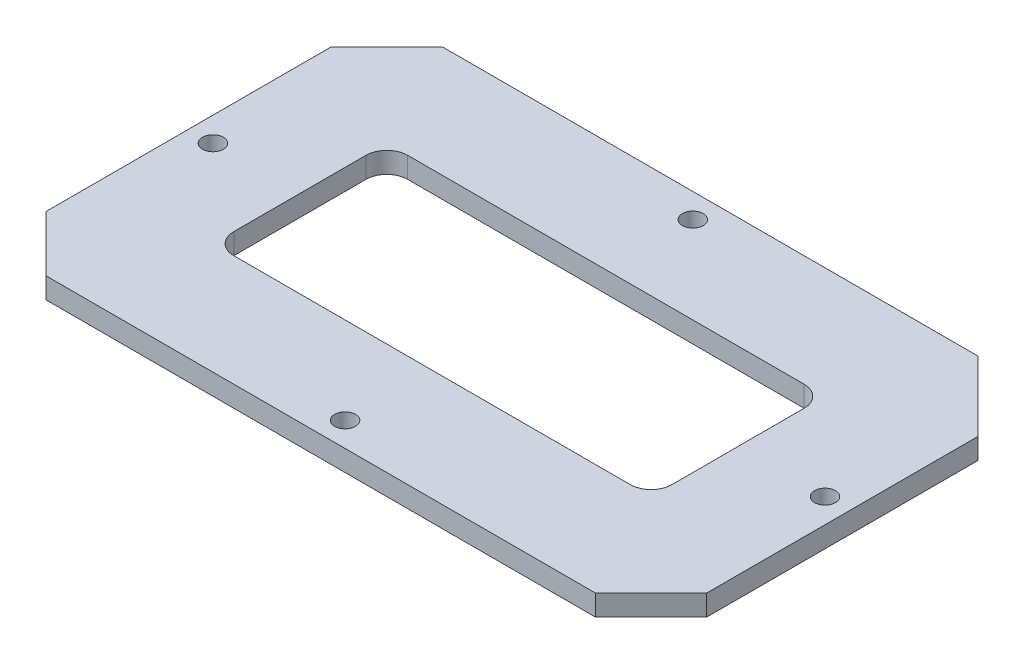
ISO-10303-21;
HEADER;
FILE_DESCRIPTION(('STEP AP214'),'2;1');
FILE_NAME('part.step','',(''),(''),'','','');
FILE_SCHEMA(('AUTOMOTIVE_DESIGN { 1 0 10303 214 1 1 1 1 }'));
ENDSEC;
DATA;
#1=APPLICATION_CONTEXT('core data for automotive mechanical design processes');
#2=APPLICATION_PROTOCOL_DEFINITION('international standard','automotive_design',2000,#1);
#3=PRODUCT_CONTEXT('',#1,'mechanical');
#4=PRODUCT('Part','Part','',(#3));
#5=PRODUCT_RELATED_PRODUCT_CATEGORY('part','',(#4));
#6=PRODUCT_DEFINITION_FORMATION('','',#4);
#7=PRODUCT_DEFINITION_CONTEXT('part definition',#1,'design');
#8=PRODUCT_DEFINITION('design','',#6,#7);
#9=PRODUCT_DEFINITION_SHAPE('','',#8);
#10=(LENGTH_UNIT() NAMED_UNIT(*) SI_UNIT(.MILLI.,.METRE.));
#11=(NAMED_UNIT(*) PLANE_ANGLE_UNIT() SI_UNIT($,.RADIAN.));
#12=(NAMED_UNIT(*) SI_UNIT($,.STERADIAN.) SOLID_ANGLE_UNIT());
#13=UNCERTAINTY_MEASURE_WITH_UNIT(LENGTH_MEASURE(1.E-05),#10,'distance_accuracy_value','');
#14=(GEOMETRIC_REPRESENTATION_CONTEXT(3) GLOBAL_UNCERTAINTY_ASSIGNED_CONTEXT((#13)) GLOBAL_UNIT_ASSIGNED_CONTEXT((#10,
#11,#12)) REPRESENTATION_CONTEXT('',''));
#15=CARTESIAN_POINT('',(0.,0.,0.));
#16=DIRECTION('',(0.,0.,1.));
#17=DIRECTION('',(1.,0.,0.));
#18=AXIS2_PLACEMENT_3D('',#15,#16,#17);
#19=CARTESIAN_POINT('',(0.,3.,0.));
#20=DIRECTION('',(0.,-1.,0.));
#21=DIRECTION('',(0.,0.,-1.));
#22=AXIS2_PLACEMENT_3D('',#19,#20,#21);
#23=PLANE('',#22);
#24=CARTESIAN_POINT('',(-44.,3.,0.));
#25=DIRECTION('',(0.,1.,0.));
#26=DIRECTION('',(0.,0.,1.));
#27=AXIS2_PLACEMENT_3D('',#24,#25,#26);
#28=CIRCLE('',#27,1.5);
#29=CARTESIAN_POINT('',(-44.,3.,1.5));
#30=VERTEX_POINT('',#29);
#31=EDGE_CURVE('E403',#30,#30,#28,.T.);
#32=ORIENTED_EDGE('',*,*,#31,.F.);
#33=EDGE_LOOP('',(#32));
#34=FACE_BOUND('',#33,.T.);
#35=CARTESIAN_POINT('',(0.,3.,-25.));
#36=DIRECTION('',(0.,1.,0.));
#37=DIRECTION('',(0.,0.,1.));
#38=AXIS2_PLACEMENT_3D('',#35,#36,#37);
#39=CIRCLE('',#38,1.5);
#40=CARTESIAN_POINT('',(0.,3.,-23.5));
#41=VERTEX_POINT('',#40);
#42=EDGE_CURVE('E198',#41,#41,#39,.T.);
#43=ORIENTED_EDGE('',*,*,#42,.F.);
#44=EDGE_LOOP('',(#43));
#45=FACE_BOUND('',#44,.T.);
#46=DIRECTION('',(-1.,0.,0.));
#47=VECTOR('',#46,1.);
#48=CARTESIAN_POINT('',(-39.5,3.,-28.5));
#49=LINE('',#48,#47);
#50=CARTESIAN_POINT('',(37.5,3.,-28.5));
#51=VERTEX_POINT('',#50);
#52=CARTESIAN_POINT('',(-39.5,3.,-28.5));
#53=VERTEX_POINT('',#52);
#54=EDGE_CURVE('E228',#51,#53,#49,.T.);
#55=ORIENTED_EDGE('',*,*,#54,.T.);
#56=DIRECTION('',(-0.707106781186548,0.,0.707106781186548));
#57=VECTOR('',#56,1.);
#58=CARTESIAN_POINT('',(-47.5,3.,-20.5));
#59=LINE('',#58,#57);
#60=CARTESIAN_POINT('',(-47.5,3.,-20.5));
#61=VERTEX_POINT('',#60);
#62=EDGE_CURVE('E231',#53,#61,#59,.T.);
#63=ORIENTED_EDGE('',*,*,#62,.T.);
#64=DIRECTION('',(0.,0.,1.));
#65=VECTOR('',#64,1.);
#66=CARTESIAN_POINT('',(-47.5,3.,-20.5));
#67=LINE('',#66,#65);
#68=CARTESIAN_POINT('',(-47.5,3.,20.5));
#69=VERTEX_POINT('',#68);
#70=EDGE_CURVE('E234',#61,#69,#67,.T.);
#71=ORIENTED_EDGE('',*,*,#70,.T.);
#72=DIRECTION('',(0.707106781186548,0.,0.707106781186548));
#73=VECTOR('',#72,1.);
#74=CARTESIAN_POINT('',(-47.5,3.,20.5));
#75=LINE('',#74,#73);
#76=CARTESIAN_POINT('',(-39.5,3.,28.5));
#77=VERTEX_POINT('',#76);
#78=EDGE_CURVE('E236',#69,#77,#75,.T.);
#79=ORIENTED_EDGE('',*,*,#78,.T.);
#80=DIRECTION('',(1.,0.,0.));
#81=VECTOR('',#80,1.);
#82=CARTESIAN_POINT('',(-39.5,3.,28.5));
#83=LINE('',#82,#81);
#84=CARTESIAN_POINT('',(39.5,3.,28.5));
#85=VERTEX_POINT('',#84);
#86=EDGE_CURVE('E238',#77,#85,#83,.T.);
#87=ORIENTED_EDGE('',*,*,#86,.T.);
#88=DIRECTION('',(0.707106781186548,0.,-0.707106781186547));
#89=VECTOR('',#88,1.);
#90=CARTESIAN_POINT('',(39.5,3.,28.5));
#91=LINE('',#90,#89);
#92=CARTESIAN_POINT('',(47.5,3.,20.5));
#93=VERTEX_POINT('',#92);
#94=EDGE_CURVE('E240',#85,#93,#91,.T.);
#95=ORIENTED_EDGE('',*,*,#94,.T.);
#96=DIRECTION('',(0.,0.,-1.));
#97=VECTOR('',#96,1.);
#98=CARTESIAN_POINT('',(47.5,3.,-18.5));
#99=LINE('',#98,#97);
#100=CARTESIAN_POINT('',(47.5,3.,-18.5));
#101=VERTEX_POINT('',#100);
#102=EDGE_CURVE('E242',#93,#101,#99,.T.);
#103=ORIENTED_EDGE('',*,*,#102,.T.);
#104=DIRECTION('',(-0.707106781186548,0.,-0.707106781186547));
#105=VECTOR('',#104,1.);
#106=CARTESIAN_POINT('',(37.5,3.,-28.5));
#107=LINE('',#106,#105);
#108=EDGE_CURVE('E244',#101,#51,#107,.T.);
#109=ORIENTED_EDGE('',*,*,#108,.T.);
#110=EDGE_LOOP('',(#55,#63,#71,#79,#87,#95,#103,#109));
#111=FACE_BOUND('',#110,.T.);
#112=CARTESIAN_POINT('',(-28.5,3.,-9.5));
#113=DIRECTION('',(0.,1.,0.));
#114=DIRECTION('',(0.,0.,1.));
#115=AXIS2_PLACEMENT_3D('',#112,#113,#114);
#116=CIRCLE('',#115,3.);
#117=CARTESIAN_POINT('',(-28.5,3.,-12.5));
#118=VERTEX_POINT('',#117);
#119=CARTESIAN_POINT('',(-31.5,3.,-9.49999999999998));
#120=VERTEX_POINT('',#119);
#121=EDGE_CURVE('E160',#118,#120,#116,.T.);
#122=ORIENTED_EDGE('',*,*,#121,.F.);
#123=DIRECTION('',(-1.,0.,0.));
#124=VECTOR('',#123,1.);
#125=CARTESIAN_POINT('',(-28.5,3.,-12.5));
#126=LINE('',#125,#124);
#127=CARTESIAN_POINT('',(28.5,3.,-12.5));
#128=VERTEX_POINT('',#127);
#129=EDGE_CURVE('E195',#128,#118,#126,.T.);
#130=ORIENTED_EDGE('',*,*,#129,.F.);
#131=CARTESIAN_POINT('',(28.5,3.,-9.50000000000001));
#132=DIRECTION('',(0.,1.,0.));
#133=DIRECTION('',(0.,0.,-1.));
#134=AXIS2_PLACEMENT_3D('',#131,#132,#133);
#135=CIRCLE('',#134,3.);
#136=CARTESIAN_POINT('',(31.5,3.,-9.49999999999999));
#137=VERTEX_POINT('',#136);
#138=EDGE_CURVE('E193',#137,#128,#135,.T.);
#139=ORIENTED_EDGE('',*,*,#138,.F.);
#140=DIRECTION('',(0.,0.,-1.));
#141=VECTOR('',#140,1.);
#142=CARTESIAN_POINT('',(31.5,3.,-9.49999999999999));
#143=LINE('',#142,#141);
#144=CARTESIAN_POINT('',(31.5,3.,9.49999999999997));
#145=VERTEX_POINT('',#144);
#146=EDGE_CURVE('E191',#145,#137,#143,.T.);
#147=ORIENTED_EDGE('',*,*,#146,.F.);
#148=CARTESIAN_POINT('',(28.5,3.,9.49999999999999));
#149=DIRECTION('',(0.,1.,0.));
#150=DIRECTION('',(0.,0.,1.));
#151=AXIS2_PLACEMENT_3D('',#148,#149,#150);
#152=CIRCLE('',#151,3.);
#153=CARTESIAN_POINT('',(28.5,3.,12.5));
#154=VERTEX_POINT('',#153);
#155=EDGE_CURVE('E189',#154,#145,#152,.T.);
#156=ORIENTED_EDGE('',*,*,#155,.F.);
#157=DIRECTION('',(1.,0.,0.));
#158=VECTOR('',#157,1.);
#159=CARTESIAN_POINT('',(-28.5,3.,12.5));
#160=LINE('',#159,#158);
#161=CARTESIAN_POINT('',(-28.5,3.,12.5));
#162=VERTEX_POINT('',#161);
#163=EDGE_CURVE('E184',#162,#154,#160,.T.);
#164=ORIENTED_EDGE('',*,*,#163,.F.);
#165=CARTESIAN_POINT('',(-28.5,3.,9.5));
#166=DIRECTION('',(0.,1.,0.));
#167=DIRECTION('',(0.,0.,1.));
#168=AXIS2_PLACEMENT_3D('',#165,#166,#167);
#169=CIRCLE('',#168,3.);
#170=CARTESIAN_POINT('',(-31.5,3.,9.49999999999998));
#171=VERTEX_POINT('',#170);
#172=EDGE_CURVE('E182',#171,#162,#169,.T.);
#173=ORIENTED_EDGE('',*,*,#172,.F.);
#174=DIRECTION('',(0.,0.,1.));
#175=VECTOR('',#174,1.);
#176=CARTESIAN_POINT('',(-31.5,3.,-9.49999999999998));
#177=LINE('',#176,#175);
#178=EDGE_CURVE('E168',#120,#171,#177,.T.);
#179=ORIENTED_EDGE('',*,*,#178,.F.);
#180=EDGE_LOOP('',(#122,#130,#139,#147,#156,#164,#173,#179));
#181=FACE_BOUND('',#180,.T.);
#182=CARTESIAN_POINT('',(0.,3.,25.));
#183=DIRECTION('',(0.,1.,0.));
#184=DIRECTION('',(0.,0.,-1.));
#185=AXIS2_PLACEMENT_3D('',#182,#183,#184);
#186=CIRCLE('',#185,1.5);
#187=CARTESIAN_POINT('',(0.,3.,23.5));
#188=VERTEX_POINT('',#187);
#189=EDGE_CURVE('E409',#188,#188,#186,.T.);
#190=ORIENTED_EDGE('',*,*,#189,.F.);
#191=EDGE_LOOP('',(#190));
#192=FACE_BOUND('',#191,.T.);
#193=CARTESIAN_POINT('',(44.,3.,0.));
#194=DIRECTION('',(0.,1.,0.));
#195=DIRECTION('',(0.,0.,-1.));
#196=AXIS2_PLACEMENT_3D('',#193,#194,#195);
#197=CIRCLE('',#196,1.5);
#198=CARTESIAN_POINT('',(44.,3.,-1.50000000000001));
#199=VERTEX_POINT('',#198);
#200=EDGE_CURVE('E394',#199,#199,#197,.T.);
#201=ORIENTED_EDGE('',*,*,#200,.F.);
#202=EDGE_LOOP('',(#201));
#203=FACE_BOUND('',#202,.T.);
#204=ADVANCED_FACE('F47',(#34,#45,#111,#181,#192,#203),#23,.F.);
#205=CARTESIAN_POINT('',(0.,0.,0.));
#206=DIRECTION('',(0.,-1.,0.));
#207=DIRECTION('',(0.,0.,-1.));
#208=AXIS2_PLACEMENT_3D('',#205,#206,#207);
#209=PLANE('',#208);
#210=CARTESIAN_POINT('',(-44.,0.,0.));
#211=DIRECTION('',(0.,1.,0.));
#212=DIRECTION('',(0.,0.,1.));
#213=AXIS2_PLACEMENT_3D('',#210,#211,#212);
#214=CIRCLE('',#213,1.5);
#215=CARTESIAN_POINT('',(-44.,0.,1.5));
#216=VERTEX_POINT('',#215);
#217=EDGE_CURVE('E400',#216,#216,#214,.T.);
#218=ORIENTED_EDGE('',*,*,#217,.T.);
#219=EDGE_LOOP('',(#218));
#220=FACE_BOUND('',#219,.T.);
#221=CARTESIAN_POINT('',(0.,0.,-25.));
#222=DIRECTION('',(0.,1.,0.));
#223=DIRECTION('',(0.,0.,1.));
#224=AXIS2_PLACEMENT_3D('',#221,#222,#223);
#225=CIRCLE('',#224,1.5);
#226=CARTESIAN_POINT('',(0.,0.,-23.5));
#227=VERTEX_POINT('',#226);
#228=EDGE_CURVE('E412',#227,#227,#225,.T.);
#229=ORIENTED_EDGE('',*,*,#228,.T.);
#230=EDGE_LOOP('',(#229));
#231=FACE_BOUND('',#230,.T.);
#232=DIRECTION('',(-1.,0.,0.));
#233=VECTOR('',#232,1.);
#234=CARTESIAN_POINT('',(-39.5,0.,-28.5));
#235=LINE('',#234,#233);
#236=CARTESIAN_POINT('',(37.5,0.,-28.5));
#237=VERTEX_POINT('',#236);
#238=CARTESIAN_POINT('',(-39.5,0.,-28.5));
#239=VERTEX_POINT('',#238);
#240=EDGE_CURVE('E176',#237,#239,#235,.T.);
#241=ORIENTED_EDGE('',*,*,#240,.F.);
#242=DIRECTION('',(-0.707106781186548,0.,-0.707106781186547));
#243=VECTOR('',#242,1.);
#244=CARTESIAN_POINT('',(37.5,0.,-28.5));
#245=LINE('',#244,#243);
#246=CARTESIAN_POINT('',(47.5,0.,-18.5));
#247=VERTEX_POINT('',#246);
#248=EDGE_CURVE('E232',#247,#237,#245,.T.);
#249=ORIENTED_EDGE('',*,*,#248,.F.);
#250=DIRECTION('',(0.,0.,-1.));
#251=VECTOR('',#250,1.);
#252=CARTESIAN_POINT('',(47.5,0.,-18.5));
#253=LINE('',#252,#251);
#254=CARTESIAN_POINT('',(47.5,0.,20.5));
#255=VERTEX_POINT('',#254);
#256=EDGE_CURVE('E259',#255,#247,#253,.T.);
#257=ORIENTED_EDGE('',*,*,#256,.F.);
#258=DIRECTION('',(0.707106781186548,0.,-0.707106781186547));
#259=VECTOR('',#258,1.);
#260=CARTESIAN_POINT('',(39.5,0.,28.5));
#261=LINE('',#260,#259);
#262=CARTESIAN_POINT('',(39.5,0.,28.5));
#263=VERTEX_POINT('',#262);
#264=EDGE_CURVE('E257',#263,#255,#261,.T.);
#265=ORIENTED_EDGE('',*,*,#264,.F.);
#266=DIRECTION('',(1.,0.,0.));
#267=VECTOR('',#266,1.);
#268=CARTESIAN_POINT('',(-39.5,0.,28.5));
#269=LINE('',#268,#267);
#270=CARTESIAN_POINT('',(-39.5,0.,28.5));
#271=VERTEX_POINT('',#270);
#272=EDGE_CURVE('E255',#271,#263,#269,.T.);
#273=ORIENTED_EDGE('',*,*,#272,.F.);
#274=DIRECTION('',(0.707106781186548,0.,0.707106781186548));
#275=VECTOR('',#274,1.);
#276=CARTESIAN_POINT('',(-47.5,0.,20.5));
#277=LINE('',#276,#275);
#278=CARTESIAN_POINT('',(-47.5,0.,20.5));
#279=VERTEX_POINT('',#278);
#280=EDGE_CURVE('E253',#279,#271,#277,.T.);
#281=ORIENTED_EDGE('',*,*,#280,.F.);
#282=DIRECTION('',(0.,0.,1.));
#283=VECTOR('',#282,1.);
#284=CARTESIAN_POINT('',(-47.5,0.,-20.5));
#285=LINE('',#284,#283);
#286=CARTESIAN_POINT('',(-47.5,0.,-20.5));
#287=VERTEX_POINT('',#286);
#288=EDGE_CURVE('E251',#287,#279,#285,.T.);
#289=ORIENTED_EDGE('',*,*,#288,.F.);
#290=DIRECTION('',(-0.707106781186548,0.,0.707106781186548));
#291=VECTOR('',#290,1.);
#292=CARTESIAN_POINT('',(-47.5,0.,-20.5));
#293=LINE('',#292,#291);
#294=EDGE_CURVE('E249',#239,#287,#293,.T.);
#295=ORIENTED_EDGE('',*,*,#294,.F.);
#296=EDGE_LOOP('',(#241,#249,#257,#265,#273,#281,#289,#295));
#297=FACE_BOUND('',#296,.T.);
#298=DIRECTION('',(-1.,0.,0.));
#299=VECTOR('',#298,1.);
#300=CARTESIAN_POINT('',(-28.5,0.,-12.5));
#301=LINE('',#300,#299);
#302=CARTESIAN_POINT('',(28.5,0.,-12.5));
#303=VERTEX_POINT('',#302);
#304=CARTESIAN_POINT('',(-28.5,0.,-12.5));
#305=VERTEX_POINT('',#304);
#306=EDGE_CURVE('E169',#303,#305,#301,.T.);
#307=ORIENTED_EDGE('',*,*,#306,.T.);
#308=CARTESIAN_POINT('',(-28.5,0.,-9.5));
#309=DIRECTION('',(0.,1.,0.));
#310=DIRECTION('',(0.,0.,1.));
#311=AXIS2_PLACEMENT_3D('',#308,#309,#310);
#312=CIRCLE('',#311,3.);
#313=CARTESIAN_POINT('',(-31.5,0.,-9.49999999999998));
#314=VERTEX_POINT('',#313);
#315=EDGE_CURVE('E70',#305,#314,#312,.T.);
#316=ORIENTED_EDGE('',*,*,#315,.T.);
#317=DIRECTION('',(0.,0.,1.));
#318=VECTOR('',#317,1.);
#319=CARTESIAN_POINT('',(-31.5,0.,-9.49999999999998));
#320=LINE('',#319,#318);
#321=CARTESIAN_POINT('',(-31.5,0.,9.49999999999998));
#322=VERTEX_POINT('',#321);
#323=EDGE_CURVE('E175',#314,#322,#320,.T.);
#324=ORIENTED_EDGE('',*,*,#323,.T.);
#325=CARTESIAN_POINT('',(-28.5,0.,9.5));
#326=DIRECTION('',(0.,1.,0.));
#327=DIRECTION('',(0.,0.,1.));
#328=AXIS2_PLACEMENT_3D('',#325,#326,#327);
#329=CIRCLE('',#328,3.);
#330=CARTESIAN_POINT('',(-28.5,0.,12.5));
#331=VERTEX_POINT('',#330);
#332=EDGE_CURVE('E200',#322,#331,#329,.T.);
#333=ORIENTED_EDGE('',*,*,#332,.T.);
#334=DIRECTION('',(1.,0.,0.));
#335=VECTOR('',#334,1.);
#336=CARTESIAN_POINT('',(-28.5,0.,12.5));
#337=LINE('',#336,#335);
#338=CARTESIAN_POINT('',(28.5,0.,12.5));
#339=VERTEX_POINT('',#338);
#340=EDGE_CURVE('E203',#331,#339,#337,.T.);
#341=ORIENTED_EDGE('',*,*,#340,.T.);
#342=CARTESIAN_POINT('',(28.5,0.,9.49999999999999));
#343=DIRECTION('',(0.,1.,0.));
#344=DIRECTION('',(0.,0.,1.));
#345=AXIS2_PLACEMENT_3D('',#342,#343,#344);
#346=CIRCLE('',#345,3.);
#347=CARTESIAN_POINT('',(31.5,0.,9.49999999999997));
#348=VERTEX_POINT('',#347);
#349=EDGE_CURVE('E206',#339,#348,#346,.T.);
#350=ORIENTED_EDGE('',*,*,#349,.T.);
#351=DIRECTION('',(0.,0.,-1.));
#352=VECTOR('',#351,1.);
#353=CARTESIAN_POINT('',(31.5,0.,-9.49999999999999));
#354=LINE('',#353,#352);
#355=CARTESIAN_POINT('',(31.5,0.,-9.49999999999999));
#356=VERTEX_POINT('',#355);
#357=EDGE_CURVE('E209',#348,#356,#354,.T.);
#358=ORIENTED_EDGE('',*,*,#357,.T.);
#359=CARTESIAN_POINT('',(28.5,0.,-9.50000000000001));
#360=DIRECTION('',(0.,1.,0.));
#361=DIRECTION('',(0.,0.,-1.));
#362=AXIS2_PLACEMENT_3D('',#359,#360,#361);
#363=CIRCLE('',#362,3.);
#364=EDGE_CURVE('E212',#356,#303,#363,.T.);
#365=ORIENTED_EDGE('',*,*,#364,.T.);
#366=EDGE_LOOP('',(#307,#316,#324,#333,#341,#350,#358,#365));
#367=FACE_BOUND('',#366,.T.);
#368=CARTESIAN_POINT('',(0.,0.,25.));
#369=DIRECTION('',(0.,1.,0.));
#370=DIRECTION('',(0.,0.,-1.));
#371=AXIS2_PLACEMENT_3D('',#368,#369,#370);
#372=CIRCLE('',#371,1.5);
#373=CARTESIAN_POINT('',(0.,0.,23.5));
#374=VERTEX_POINT('',#373);
#375=EDGE_CURVE('E406',#374,#374,#372,.T.);
#376=ORIENTED_EDGE('',*,*,#375,.T.);
#377=EDGE_LOOP('',(#376));
#378=FACE_BOUND('',#377,.T.);
#379=CARTESIAN_POINT('',(44.,0.,0.));
#380=DIRECTION('',(0.,1.,0.));
#381=DIRECTION('',(0.,0.,-1.));
#382=AXIS2_PLACEMENT_3D('',#379,#380,#381);
#383=CIRCLE('',#382,1.5);
#384=CARTESIAN_POINT('',(44.,0.,-1.50000000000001));
#385=VERTEX_POINT('',#384);
#386=EDGE_CURVE('E397',#385,#385,#383,.T.);
#387=ORIENTED_EDGE('',*,*,#386,.T.);
#388=EDGE_LOOP('',(#387));
#389=FACE_BOUND('',#388,.T.);
#390=ADVANCED_FACE('F289',(#220,#231,#297,#367,#378,#389),#209,.T.);
#391=CARTESIAN_POINT('',(-39.5,3.,-28.5));
#392=DIRECTION('',(0.,0.,1.));
#393=DIRECTION('',(1.,0.,0.));
#394=AXIS2_PLACEMENT_3D('',#391,#392,#393);
#395=PLANE('',#394);
#396=ORIENTED_EDGE('',*,*,#240,.T.);
#397=DIRECTION('',(0.,-1.,0.));
#398=VECTOR('',#397,1.);
#399=CARTESIAN_POINT('',(-39.5,3.,-28.5));
#400=LINE('',#399,#398);
#401=EDGE_CURVE('E13',#53,#239,#400,.T.);
#402=ORIENTED_EDGE('',*,*,#401,.F.);
#403=ORIENTED_EDGE('',*,*,#54,.F.);
#404=DIRECTION('',(0.,-1.,0.));
#405=VECTOR('',#404,1.);
#406=CARTESIAN_POINT('',(37.5,3.,-28.5));
#407=LINE('',#406,#405);
#408=EDGE_CURVE('E246',#51,#237,#407,.T.);
#409=ORIENTED_EDGE('',*,*,#408,.T.);
#410=EDGE_LOOP('',(#396,#402,#403,#409));
#411=FACE_BOUND('',#410,.T.);
#412=ADVANCED_FACE('F49',(#411),#395,.F.);
#413=CARTESIAN_POINT('',(-47.5,3.,-20.5));
#414=DIRECTION('',(0.707106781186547,0.,0.707106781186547));
#415=DIRECTION('',(0.707106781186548,0.,-0.707106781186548));
#416=AXIS2_PLACEMENT_3D('',#413,#414,#415);
#417=PLANE('',#416);
#418=ORIENTED_EDGE('',*,*,#294,.T.);
#419=DIRECTION('',(0.,-1.,0.));
#420=VECTOR('',#419,1.);
#421=CARTESIAN_POINT('',(-47.5,3.,-20.5));
#422=LINE('',#421,#420);
#423=EDGE_CURVE('E55',#61,#287,#422,.T.);
#424=ORIENTED_EDGE('',*,*,#423,.F.);
#425=ORIENTED_EDGE('',*,*,#62,.F.);
#426=ORIENTED_EDGE('',*,*,#401,.T.);
#427=EDGE_LOOP('',(#418,#424,#425,#426));
#428=FACE_BOUND('',#427,.T.);
#429=ADVANCED_FACE('F306',(#428),#417,.F.);
#430=CARTESIAN_POINT('',(-47.5,3.,-20.5));
#431=DIRECTION('',(1.,0.,0.));
#432=DIRECTION('',(0.,0.,-1.));
#433=AXIS2_PLACEMENT_3D('',#430,#431,#432);
#434=PLANE('',#433);
#435=ORIENTED_EDGE('',*,*,#288,.T.);
#436=DIRECTION('',(0.,-1.,0.));
#437=VECTOR('',#436,1.);
#438=CARTESIAN_POINT('',(-47.5,3.,20.5));
#439=LINE('',#438,#437);
#440=EDGE_CURVE('E276',#69,#279,#439,.T.);
#441=ORIENTED_EDGE('',*,*,#440,.F.);
#442=ORIENTED_EDGE('',*,*,#70,.F.);
#443=ORIENTED_EDGE('',*,*,#423,.T.);
#444=EDGE_LOOP('',(#435,#441,#442,#443));
#445=FACE_BOUND('',#444,.T.);
#446=ADVANCED_FACE('F283',(#445),#434,.F.);
#447=CARTESIAN_POINT('',(-47.5,3.,20.5));
#448=DIRECTION('',(0.707106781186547,0.,-0.707106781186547));
#449=DIRECTION('',(-0.707106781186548,0.,-0.707106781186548));
#450=AXIS2_PLACEMENT_3D('',#447,#448,#449);
#451=PLANE('',#450);
#452=ORIENTED_EDGE('',*,*,#280,.T.);
#453=DIRECTION('',(0.,-1.,0.));
#454=VECTOR('',#453,1.);
#455=CARTESIAN_POINT('',(-39.5,3.,28.5));
#456=LINE('',#455,#454);
#457=EDGE_CURVE('E273',#77,#271,#456,.T.);
#458=ORIENTED_EDGE('',*,*,#457,.F.);
#459=ORIENTED_EDGE('',*,*,#78,.F.);
#460=ORIENTED_EDGE('',*,*,#440,.T.);
#461=EDGE_LOOP('',(#452,#458,#459,#460));
#462=FACE_BOUND('',#461,.T.);
#463=ADVANCED_FACE('F295',(#462),#451,.F.);
#464=CARTESIAN_POINT('',(-39.5,3.,28.5));
#465=DIRECTION('',(0.,0.,-1.));
#466=DIRECTION('',(-1.,0.,0.));
#467=AXIS2_PLACEMENT_3D('',#464,#465,#466);
#468=PLANE('',#467);
#469=ORIENTED_EDGE('',*,*,#272,.T.);
#470=DIRECTION('',(0.,-1.,0.));
#471=VECTOR('',#470,1.);
#472=CARTESIAN_POINT('',(39.5,3.,28.5));
#473=LINE('',#472,#471);
#474=EDGE_CURVE('E270',#85,#263,#473,.T.);
#475=ORIENTED_EDGE('',*,*,#474,.F.);
#476=ORIENTED_EDGE('',*,*,#86,.F.);
#477=ORIENTED_EDGE('',*,*,#457,.T.);
#478=EDGE_LOOP('',(#469,#475,#476,#477));
#479=FACE_BOUND('',#478,.T.);
#480=ADVANCED_FACE('F299',(#479),#468,.F.);
#481=CARTESIAN_POINT('',(39.5,3.,28.5));
#482=DIRECTION('',(-0.707106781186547,0.,-0.707106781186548));
#483=DIRECTION('',(-0.707106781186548,0.,0.707106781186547));
#484=AXIS2_PLACEMENT_3D('',#481,#482,#483);
#485=PLANE('',#484);
#486=ORIENTED_EDGE('',*,*,#264,.T.);
#487=DIRECTION('',(0.,-1.,0.));
#488=VECTOR('',#487,1.);
#489=CARTESIAN_POINT('',(47.5,3.,20.5));
#490=LINE('',#489,#488);
#491=EDGE_CURVE('E267',#93,#255,#490,.T.);
#492=ORIENTED_EDGE('',*,*,#491,.F.);
#493=ORIENTED_EDGE('',*,*,#94,.F.);
#494=ORIENTED_EDGE('',*,*,#474,.T.);
#495=EDGE_LOOP('',(#486,#492,#493,#494));
#496=FACE_BOUND('',#495,.T.);
#497=ADVANCED_FACE('F319',(#496),#485,.F.);
#498=CARTESIAN_POINT('',(47.5,3.,-18.5));
#499=DIRECTION('',(-1.,0.,0.));
#500=DIRECTION('',(0.,0.,1.));
#501=AXIS2_PLACEMENT_3D('',#498,#499,#500);
#502=PLANE('',#501);
#503=ORIENTED_EDGE('',*,*,#256,.T.);
#504=DIRECTION('',(0.,-1.,0.));
#505=VECTOR('',#504,1.);
#506=CARTESIAN_POINT('',(47.5,3.,-18.5));
#507=LINE('',#506,#505);
#508=EDGE_CURVE('E264',#101,#247,#507,.T.);
#509=ORIENTED_EDGE('',*,*,#508,.F.);
#510=ORIENTED_EDGE('',*,*,#102,.F.);
#511=ORIENTED_EDGE('',*,*,#491,.T.);
#512=EDGE_LOOP('',(#503,#509,#510,#511));
#513=FACE_BOUND('',#512,.T.);
#514=ADVANCED_FACE('F317',(#513),#502,.F.);
#515=CARTESIAN_POINT('',(37.5,3.,-28.5));
#516=DIRECTION('',(-0.707106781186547,0.,0.707106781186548));
#517=DIRECTION('',(0.707106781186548,0.,0.707106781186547));
#518=AXIS2_PLACEMENT_3D('',#515,#516,#517);
#519=PLANE('',#518);
#520=ORIENTED_EDGE('',*,*,#248,.T.);
#521=ORIENTED_EDGE('',*,*,#408,.F.);
#522=ORIENTED_EDGE('',*,*,#108,.F.);
#523=ORIENTED_EDGE('',*,*,#508,.T.);
#524=EDGE_LOOP('',(#520,#521,#522,#523));
#525=FACE_BOUND('',#524,.T.);
#526=ADVANCED_FACE('F312',(#525),#519,.F.);
#527=CARTESIAN_POINT('',(-28.5,3.,-9.5));
#528=DIRECTION('',(0.,-1.,0.));
#529=DIRECTION('',(0.,0.,-1.));
#530=AXIS2_PLACEMENT_3D('',#527,#528,#529);
#531=CYLINDRICAL_SURFACE('',#530,3.);
#532=ORIENTED_EDGE('',*,*,#315,.F.);
#533=DIRECTION('',(0.,-1.,0.));
#534=VECTOR('',#533,1.);
#535=CARTESIAN_POINT('',(-28.5,3.,-12.5));
#536=LINE('',#535,#534);
#537=EDGE_CURVE('E164',#118,#305,#536,.T.);
#538=ORIENTED_EDGE('',*,*,#537,.F.);
#539=ORIENTED_EDGE('',*,*,#121,.T.);
#540=DIRECTION('',(0.,-1.,0.));
#541=VECTOR('',#540,1.);
#542=CARTESIAN_POINT('',(-31.5,3.,-9.49999999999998));
#543=LINE('',#542,#541);
#544=EDGE_CURVE('E163',#120,#314,#543,.T.);
#545=ORIENTED_EDGE('',*,*,#544,.T.);
#546=EDGE_LOOP('',(#532,#538,#539,#545));
#547=FACE_BOUND('',#546,.T.);
#548=ADVANCED_FACE('F162',(#547),#531,.F.);
#549=CARTESIAN_POINT('',(-31.5,3.,-9.49999999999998));
#550=DIRECTION('',(1.,0.,0.));
#551=DIRECTION('',(0.,0.,-1.));
#552=AXIS2_PLACEMENT_3D('',#549,#550,#551);
#553=PLANE('',#552);
#554=ORIENTED_EDGE('',*,*,#323,.F.);
#555=ORIENTED_EDGE('',*,*,#544,.F.);
#556=ORIENTED_EDGE('',*,*,#178,.T.);
#557=DIRECTION('',(0.,-1.,0.));
#558=VECTOR('',#557,1.);
#559=CARTESIAN_POINT('',(-31.5,3.,9.49999999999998));
#560=LINE('',#559,#558);
#561=EDGE_CURVE('E177',#171,#322,#560,.T.);
#562=ORIENTED_EDGE('',*,*,#561,.T.);
#563=EDGE_LOOP('',(#554,#555,#556,#562));
#564=FACE_BOUND('',#563,.T.);
#565=ADVANCED_FACE('F172',(#564),#553,.T.);
#566=CARTESIAN_POINT('',(-28.5,3.,9.5));
#567=DIRECTION('',(0.,-1.,0.));
#568=DIRECTION('',(0.,0.,-1.));
#569=AXIS2_PLACEMENT_3D('',#566,#567,#568);
#570=CYLINDRICAL_SURFACE('',#569,3.);
#571=ORIENTED_EDGE('',*,*,#332,.F.);
#572=ORIENTED_EDGE('',*,*,#561,.F.);
#573=ORIENTED_EDGE('',*,*,#172,.T.);
#574=DIRECTION('',(0.,-1.,0.));
#575=VECTOR('',#574,1.);
#576=CARTESIAN_POINT('',(-28.5,3.,12.5));
#577=LINE('',#576,#575);
#578=EDGE_CURVE('E225',#162,#331,#577,.T.);
#579=ORIENTED_EDGE('',*,*,#578,.T.);
#580=EDGE_LOOP('',(#571,#572,#573,#579));
#581=FACE_BOUND('',#580,.T.);
#582=ADVANCED_FACE('F348',(#581),#570,.F.);
#583=CARTESIAN_POINT('',(-28.5,3.,12.5));
#584=DIRECTION('',(0.,0.,-1.));
#585=DIRECTION('',(-1.,0.,0.));
#586=AXIS2_PLACEMENT_3D('',#583,#584,#585);
#587=PLANE('',#586);
#588=ORIENTED_EDGE('',*,*,#340,.F.);
#589=ORIENTED_EDGE('',*,*,#578,.F.);
#590=ORIENTED_EDGE('',*,*,#163,.T.);
#591=DIRECTION('',(0.,-1.,0.));
#592=VECTOR('',#591,1.);
#593=CARTESIAN_POINT('',(28.5,3.,12.5));
#594=LINE('',#593,#592);
#595=EDGE_CURVE('E223',#154,#339,#594,.T.);
#596=ORIENTED_EDGE('',*,*,#595,.T.);
#597=EDGE_LOOP('',(#588,#589,#590,#596));
#598=FACE_BOUND('',#597,.T.);
#599=ADVANCED_FACE('F352',(#598),#587,.T.);
#600=CARTESIAN_POINT('',(28.5,3.,9.49999999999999));
#601=DIRECTION('',(0.,-1.,0.));
#602=DIRECTION('',(0.,0.,-1.));
#603=AXIS2_PLACEMENT_3D('',#600,#601,#602);
#604=CYLINDRICAL_SURFACE('',#603,3.);
#605=ORIENTED_EDGE('',*,*,#349,.F.);
#606=ORIENTED_EDGE('',*,*,#595,.F.);
#607=ORIENTED_EDGE('',*,*,#155,.T.);
#608=DIRECTION('',(0.,-1.,0.));
#609=VECTOR('',#608,1.);
#610=CARTESIAN_POINT('',(31.5,3.,9.49999999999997));
#611=LINE('',#610,#609);
#612=EDGE_CURVE('E221',#145,#348,#611,.T.);
#613=ORIENTED_EDGE('',*,*,#612,.T.);
#614=EDGE_LOOP('',(#605,#606,#607,#613));
#615=FACE_BOUND('',#614,.T.);
#616=ADVANCED_FACE('F358',(#615),#604,.F.);
#617=CARTESIAN_POINT('',(31.5,3.,-9.49999999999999));
#618=DIRECTION('',(-1.,0.,0.));
#619=DIRECTION('',(0.,0.,1.));
#620=AXIS2_PLACEMENT_3D('',#617,#618,#619);
#621=PLANE('',#620);
#622=ORIENTED_EDGE('',*,*,#357,.F.);
#623=ORIENTED_EDGE('',*,*,#612,.F.);
#624=ORIENTED_EDGE('',*,*,#146,.T.);
#625=DIRECTION('',(0.,-1.,0.));
#626=VECTOR('',#625,1.);
#627=CARTESIAN_POINT('',(31.5,3.,-9.49999999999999));
#628=LINE('',#627,#626);
#629=EDGE_CURVE('E219',#137,#356,#628,.T.);
#630=ORIENTED_EDGE('',*,*,#629,.T.);
#631=EDGE_LOOP('',(#622,#623,#624,#630));
#632=FACE_BOUND('',#631,.T.);
#633=ADVANCED_FACE('F362',(#632),#621,.T.);
#634=CARTESIAN_POINT('',(28.5,3.,-9.50000000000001));
#635=DIRECTION('',(0.,-1.,0.));
#636=DIRECTION('',(0.,0.,-1.));
#637=AXIS2_PLACEMENT_3D('',#634,#635,#636);
#638=CYLINDRICAL_SURFACE('',#637,3.);
#639=ORIENTED_EDGE('',*,*,#364,.F.);
#640=ORIENTED_EDGE('',*,*,#629,.F.);
#641=ORIENTED_EDGE('',*,*,#138,.T.);
#642=DIRECTION('',(0.,-1.,0.));
#643=VECTOR('',#642,1.);
#644=CARTESIAN_POINT('',(28.5,3.,-12.5));
#645=LINE('',#644,#643);
#646=EDGE_CURVE('E62',#128,#303,#645,.T.);
#647=ORIENTED_EDGE('',*,*,#646,.T.);
#648=EDGE_LOOP('',(#639,#640,#641,#647));
#649=FACE_BOUND('',#648,.T.);
#650=ADVANCED_FACE('F366',(#649),#638,.F.);
#651=CARTESIAN_POINT('',(-28.5,3.,-12.5));
#652=DIRECTION('',(0.,0.,1.));
#653=DIRECTION('',(1.,0.,0.));
#654=AXIS2_PLACEMENT_3D('',#651,#652,#653);
#655=PLANE('',#654);
#656=ORIENTED_EDGE('',*,*,#306,.F.);
#657=ORIENTED_EDGE('',*,*,#646,.F.);
#658=ORIENTED_EDGE('',*,*,#129,.T.);
#659=ORIENTED_EDGE('',*,*,#537,.T.);
#660=EDGE_LOOP('',(#656,#657,#658,#659));
#661=FACE_BOUND('',#660,.T.);
#662=ADVANCED_FACE('F370',(#661),#655,.T.);
#663=CARTESIAN_POINT('',(0.,3.,-25.));
#664=DIRECTION('',(0.,-1.,0.));
#665=DIRECTION('',(0.,0.,-1.));
#666=AXIS2_PLACEMENT_3D('',#663,#664,#665);
#667=CYLINDRICAL_SURFACE('',#666,1.5);
#668=ORIENTED_EDGE('',*,*,#42,.T.);
#669=EDGE_LOOP('',(#668));
#670=FACE_BOUND('',#669,.T.);
#671=ORIENTED_EDGE('',*,*,#228,.F.);
#672=EDGE_LOOP('',(#671));
#673=FACE_BOUND('',#672,.T.);
#674=ADVANCED_FACE('F374',(#670,#673),#667,.F.);
#675=CARTESIAN_POINT('',(0.,3.,25.));
#676=DIRECTION('',(0.,-1.,0.));
#677=DIRECTION('',(0.,0.,-1.));
#678=AXIS2_PLACEMENT_3D('',#675,#676,#677);
#679=CYLINDRICAL_SURFACE('',#678,1.5);
#680=ORIENTED_EDGE('',*,*,#189,.T.);
#681=EDGE_LOOP('',(#680));
#682=FACE_BOUND('',#681,.T.);
#683=ORIENTED_EDGE('',*,*,#375,.F.);
#684=EDGE_LOOP('',(#683));
#685=FACE_BOUND('',#684,.T.);
#686=ADVANCED_FACE('F377',(#682,#685),#679,.F.);
#687=CARTESIAN_POINT('',(-44.,3.,0.));
#688=DIRECTION('',(0.,-1.,0.));
#689=DIRECTION('',(0.,0.,-1.));
#690=AXIS2_PLACEMENT_3D('',#687,#688,#689);
#691=CYLINDRICAL_SURFACE('',#690,1.5);
#692=ORIENTED_EDGE('',*,*,#31,.T.);
#693=EDGE_LOOP('',(#692));
#694=FACE_BOUND('',#693,.T.);
#695=ORIENTED_EDGE('',*,*,#217,.F.);
#696=EDGE_LOOP('',(#695));
#697=FACE_BOUND('',#696,.T.);
#698=ADVANCED_FACE('F381',(#694,#697),#691,.F.);
#699=CARTESIAN_POINT('',(44.,3.,0.));
#700=DIRECTION('',(0.,-1.,0.));
#701=DIRECTION('',(0.,0.,-1.));
#702=AXIS2_PLACEMENT_3D('',#699,#700,#701);
#703=CYLINDRICAL_SURFACE('',#702,1.5);
#704=ORIENTED_EDGE('',*,*,#200,.T.);
#705=EDGE_LOOP('',(#704));
#706=FACE_BOUND('',#705,.T.);
#707=ORIENTED_EDGE('',*,*,#386,.F.);
#708=EDGE_LOOP('',(#707));
#709=FACE_BOUND('',#708,.T.);
#710=ADVANCED_FACE('F385',(#706,#709),#703,.F.);
#711=CLOSED_SHELL('',(#204,#390,#412,#429,#446,#463,#480,#497,#514,#526,#548,#565,#582,#599,
#616,#633,#650,#662,#674,#686,#698,#710));
#712=MANIFOLD_SOLID_BREP('B2',#711);
#713=ADVANCED_BREP_SHAPE_REPRESENTATION('',(#18,#712),#14);
#714=SHAPE_DEFINITION_REPRESENTATION(#9,#713);
ENDSEC;
END-ISO-10303-21;
